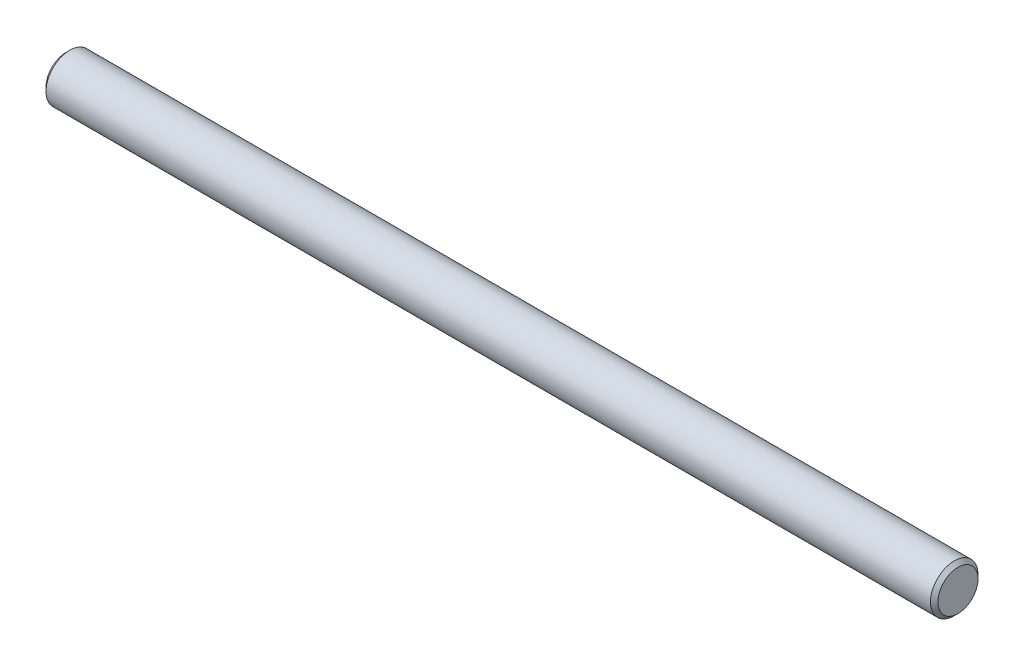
from build123d import *

# Parameters (mm, degrees)
ESQUISSE1_W     = 150
ESQUISSE1_H     = 4
CHANFREIN1_SIZE = 0.625


with BuildPart() as part:
    # Esquisse1 → cylindre (revolve)
    with BuildSketch(Plane.XY, mode=Mode.PRIVATE) as cylindre_sk:
        with Locations((75, 2)):
            Rectangle(ESQUISSE1_W, ESQUISSE1_H)
    revolve(cylindre_sk.sketch.rotate(Axis((0, 0, 0), (1, 0, 0)), 90), axis=Axis((0, 0, 0), (1, 0, 0)))

    # Chanfrein1
    chanfrein1_edges = [part.edges().sort_by_distance(p)[0] for p in [
        (150, 0, -4),
        (0, 0, -4),
    ]]
    chamfer(chanfrein1_edges, length=CHANFREIN1_SIZE)


solid = part.part
